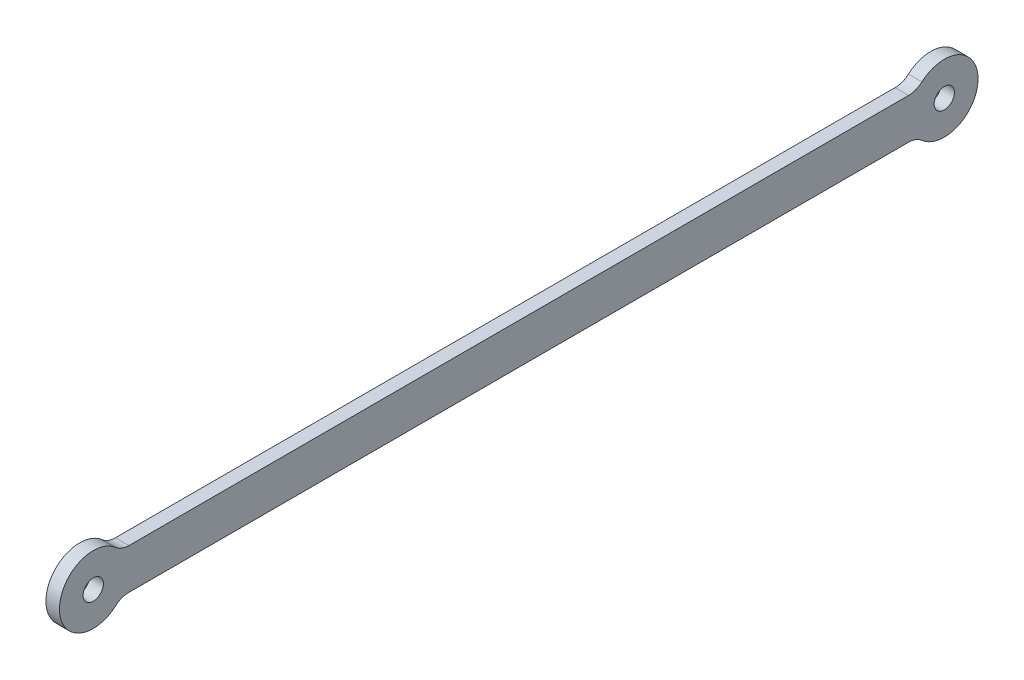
ISO-10303-21;
HEADER;
FILE_DESCRIPTION(('STEP AP214'),'2;1');
FILE_NAME('part.step','',(''),(''),'','','');
FILE_SCHEMA(('AUTOMOTIVE_DESIGN { 1 0 10303 214 1 1 1 1 }'));
ENDSEC;
DATA;
#1=APPLICATION_CONTEXT('core data for automotive mechanical design processes');
#2=APPLICATION_PROTOCOL_DEFINITION('international standard','automotive_design',2000,#1);
#3=PRODUCT_CONTEXT('',#1,'mechanical');
#4=PRODUCT('Part','Part','',(#3));
#5=PRODUCT_RELATED_PRODUCT_CATEGORY('part','',(#4));
#6=PRODUCT_DEFINITION_FORMATION('','',#4);
#7=PRODUCT_DEFINITION_CONTEXT('part definition',#1,'design');
#8=PRODUCT_DEFINITION('design','',#6,#7);
#9=PRODUCT_DEFINITION_SHAPE('','',#8);
#10=(LENGTH_UNIT() NAMED_UNIT(*) SI_UNIT(.MILLI.,.METRE.));
#11=(NAMED_UNIT(*) PLANE_ANGLE_UNIT() SI_UNIT($,.RADIAN.));
#12=(NAMED_UNIT(*) SI_UNIT($,.STERADIAN.) SOLID_ANGLE_UNIT());
#13=UNCERTAINTY_MEASURE_WITH_UNIT(LENGTH_MEASURE(1.E-05),#10,'distance_accuracy_value','');
#14=(GEOMETRIC_REPRESENTATION_CONTEXT(3) GLOBAL_UNCERTAINTY_ASSIGNED_CONTEXT((#13)) GLOBAL_UNIT_ASSIGNED_CONTEXT((#10,
#11,#12)) REPRESENTATION_CONTEXT('',''));
#15=CARTESIAN_POINT('',(0.,0.,0.));
#16=DIRECTION('',(0.,0.,1.));
#17=DIRECTION('',(1.,0.,0.));
#18=AXIS2_PLACEMENT_3D('',#15,#16,#17);
#19=CARTESIAN_POINT('',(2.,0.,0.));
#20=DIRECTION('',(1.,0.,0.));
#21=DIRECTION('',(0.,0.,-1.));
#22=AXIS2_PLACEMENT_3D('',#19,#20,#21);
#23=PLANE('',#22);
#24=CARTESIAN_POINT('',(2.,0.,126.));
#25=DIRECTION('',(1.,0.,0.));
#26=DIRECTION('',(0.,0.,-1.));
#27=AXIS2_PLACEMENT_3D('',#24,#25,#26);
#28=CIRCLE('',#27,5.);
#29=CARTESIAN_POINT('',(2.,3.74999999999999,122.692810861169));
#30=VERTEX_POINT('',#29);
#31=CARTESIAN_POINT('',(2.,-3.75000000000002,122.692810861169));
#32=VERTEX_POINT('',#31);
#33=EDGE_CURVE('E192',#30,#32,#28,.T.);
#34=ORIENTED_EDGE('',*,*,#33,.T.);
#35=CARTESIAN_POINT('',(2.,-6.00000000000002,120.708497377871));
#36=DIRECTION('',(1.,0.,0.));
#37=DIRECTION('',(0.,0.,-1.));
#38=AXIS2_PLACEMENT_3D('',#35,#36,#37);
#39=CIRCLE('',#38,3.);
#40=CARTESIAN_POINT('',(2.,-3.00000000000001,120.708497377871));
#41=VERTEX_POINT('',#40);
#42=EDGE_CURVE('E166',#32,#41,#39,.F.);
#43=ORIENTED_EDGE('',*,*,#42,.T.);
#44=DIRECTION('',(0.,0.,-1.));
#45=VECTOR('',#44,1.);
#46=CARTESIAN_POINT('',(2.,-3.,0.));
#47=LINE('',#46,#45);
#48=CARTESIAN_POINT('',(2.,-3.,5.29150262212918));
#49=VERTEX_POINT('',#48);
#50=EDGE_CURVE('E125',#41,#49,#47,.T.);
#51=ORIENTED_EDGE('',*,*,#50,.T.);
#52=CARTESIAN_POINT('',(2.,-6.,5.29150262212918));
#53=DIRECTION('',(1.,0.,0.));
#54=DIRECTION('',(0.,0.,-1.));
#55=AXIS2_PLACEMENT_3D('',#52,#53,#54);
#56=CIRCLE('',#55,3.);
#57=CARTESIAN_POINT('',(2.,-3.75,3.30718913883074));
#58=VERTEX_POINT('',#57);
#59=EDGE_CURVE('E169',#49,#58,#56,.F.);
#60=ORIENTED_EDGE('',*,*,#59,.T.);
#61=CARTESIAN_POINT('',(2.,0.,0.));
#62=DIRECTION('',(1.,0.,0.));
#63=DIRECTION('',(0.,0.,-1.));
#64=AXIS2_PLACEMENT_3D('',#61,#62,#63);
#65=CIRCLE('',#64,5.);
#66=CARTESIAN_POINT('',(2.,3.75,3.30718913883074));
#67=VERTEX_POINT('',#66);
#68=EDGE_CURVE('E112',#58,#67,#65,.T.);
#69=ORIENTED_EDGE('',*,*,#68,.T.);
#70=CARTESIAN_POINT('',(2.,6.,5.29150262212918));
#71=DIRECTION('',(1.,0.,0.));
#72=DIRECTION('',(0.,0.,-1.));
#73=AXIS2_PLACEMENT_3D('',#70,#71,#72);
#74=CIRCLE('',#73,3.);
#75=CARTESIAN_POINT('',(2.,3.,5.29150262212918));
#76=VERTEX_POINT('',#75);
#77=EDGE_CURVE('E11',#67,#76,#74,.F.);
#78=ORIENTED_EDGE('',*,*,#77,.T.);
#79=DIRECTION('',(0.,0.,1.));
#80=VECTOR('',#79,1.);
#81=CARTESIAN_POINT('',(2.,3.,0.));
#82=LINE('',#81,#80);
#83=CARTESIAN_POINT('',(2.,2.99999999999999,120.708497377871));
#84=VERTEX_POINT('',#83);
#85=EDGE_CURVE('E111',#76,#84,#82,.T.);
#86=ORIENTED_EDGE('',*,*,#85,.T.);
#87=CARTESIAN_POINT('',(2.,5.99999999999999,120.708497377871));
#88=DIRECTION('',(1.,0.,0.));
#89=DIRECTION('',(0.,0.,-1.));
#90=AXIS2_PLACEMENT_3D('',#87,#88,#89);
#91=CIRCLE('',#90,3.);
#92=EDGE_CURVE('E157',#84,#30,#91,.F.);
#93=ORIENTED_EDGE('',*,*,#92,.T.);
#94=EDGE_LOOP('',(#34,#43,#51,#60,#69,#78,#86,#93));
#95=FACE_BOUND('',#94,.T.);
#96=CARTESIAN_POINT('',(2.,0.,126.));
#97=DIRECTION('',(1.,0.,0.));
#98=DIRECTION('',(0.,0.,-1.));
#99=AXIS2_PLACEMENT_3D('',#96,#97,#98);
#100=CIRCLE('',#99,1.5);
#101=CARTESIAN_POINT('',(2.,0.,124.5));
#102=VERTEX_POINT('',#101);
#103=EDGE_CURVE('E212',#102,#102,#100,.T.);
#104=ORIENTED_EDGE('',*,*,#103,.F.);
#105=EDGE_LOOP('',(#104));
#106=FACE_BOUND('',#105,.T.);
#107=CARTESIAN_POINT('',(2.,0.,0.));
#108=DIRECTION('',(1.,0.,0.));
#109=DIRECTION('',(0.,0.,-1.));
#110=AXIS2_PLACEMENT_3D('',#107,#108,#109);
#111=CIRCLE('',#110,1.5);
#112=CARTESIAN_POINT('',(2.,0.,-1.5));
#113=VERTEX_POINT('',#112);
#114=EDGE_CURVE('E204',#113,#113,#111,.T.);
#115=ORIENTED_EDGE('',*,*,#114,.F.);
#116=EDGE_LOOP('',(#115));
#117=FACE_BOUND('',#116,.T.);
#118=ADVANCED_FACE('F42',(#95,#106,#117),#23,.T.);
#119=CARTESIAN_POINT('',(0.,0.,0.));
#120=DIRECTION('',(1.,0.,0.));
#121=DIRECTION('',(0.,0.,-1.));
#122=AXIS2_PLACEMENT_3D('',#119,#120,#121);
#123=PLANE('',#122);
#124=DIRECTION('',(0.,0.,1.));
#125=VECTOR('',#124,1.);
#126=CARTESIAN_POINT('',(0.,3.,0.));
#127=LINE('',#126,#125);
#128=CARTESIAN_POINT('',(0.,3.,5.29150262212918));
#129=VERTEX_POINT('',#128);
#130=CARTESIAN_POINT('',(0.,2.99999999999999,120.708497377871));
#131=VERTEX_POINT('',#130);
#132=EDGE_CURVE('E188',#129,#131,#127,.T.);
#133=ORIENTED_EDGE('',*,*,#132,.F.);
#134=CARTESIAN_POINT('',(0.,6.,5.29150262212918));
#135=DIRECTION('',(1.,0.,0.));
#136=DIRECTION('',(0.,0.,-1.));
#137=AXIS2_PLACEMENT_3D('',#134,#135,#136);
#138=CIRCLE('',#137,3.);
#139=CARTESIAN_POINT('',(0.,3.75,3.30718913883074));
#140=VERTEX_POINT('',#139);
#141=EDGE_CURVE('E51',#129,#140,#138,.T.);
#142=ORIENTED_EDGE('',*,*,#141,.T.);
#143=CARTESIAN_POINT('',(0.,0.,0.));
#144=DIRECTION('',(1.,0.,0.));
#145=DIRECTION('',(0.,0.,-1.));
#146=AXIS2_PLACEMENT_3D('',#143,#144,#145);
#147=CIRCLE('',#146,5.);
#148=CARTESIAN_POINT('',(0.,-3.75,3.30718913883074));
#149=VERTEX_POINT('',#148);
#150=EDGE_CURVE('E180',#140,#149,#147,.F.);
#151=ORIENTED_EDGE('',*,*,#150,.T.);
#152=CARTESIAN_POINT('',(0.,-6.,5.29150262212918));
#153=DIRECTION('',(1.,0.,0.));
#154=DIRECTION('',(0.,0.,-1.));
#155=AXIS2_PLACEMENT_3D('',#152,#153,#154);
#156=CIRCLE('',#155,3.);
#157=CARTESIAN_POINT('',(0.,-3.,5.29150262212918));
#158=VERTEX_POINT('',#157);
#159=EDGE_CURVE('E172',#149,#158,#156,.T.);
#160=ORIENTED_EDGE('',*,*,#159,.T.);
#161=DIRECTION('',(0.,0.,-1.));
#162=VECTOR('',#161,1.);
#163=CARTESIAN_POINT('',(0.,-3.,0.));
#164=LINE('',#163,#162);
#165=CARTESIAN_POINT('',(0.,-3.00000000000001,120.708497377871));
#166=VERTEX_POINT('',#165);
#167=EDGE_CURVE('E126',#166,#158,#164,.T.);
#168=ORIENTED_EDGE('',*,*,#167,.F.);
#169=CARTESIAN_POINT('',(0.,-6.00000000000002,120.708497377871));
#170=DIRECTION('',(1.,0.,0.));
#171=DIRECTION('',(0.,0.,-1.));
#172=AXIS2_PLACEMENT_3D('',#169,#170,#171);
#173=CIRCLE('',#172,3.);
#174=CARTESIAN_POINT('',(0.,-3.75000000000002,122.692810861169));
#175=VERTEX_POINT('',#174);
#176=EDGE_CURVE('E163',#166,#175,#173,.T.);
#177=ORIENTED_EDGE('',*,*,#176,.T.);
#178=CARTESIAN_POINT('',(0.,0.,126.));
#179=DIRECTION('',(1.,0.,0.));
#180=DIRECTION('',(0.,0.,-1.));
#181=AXIS2_PLACEMENT_3D('',#178,#179,#180);
#182=CIRCLE('',#181,5.);
#183=CARTESIAN_POINT('',(0.,3.74999999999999,122.692810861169));
#184=VERTEX_POINT('',#183);
#185=EDGE_CURVE('E196',#175,#184,#182,.F.);
#186=ORIENTED_EDGE('',*,*,#185,.T.);
#187=CARTESIAN_POINT('',(0.,5.99999999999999,120.708497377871));
#188=DIRECTION('',(1.,0.,0.));
#189=DIRECTION('',(0.,0.,-1.));
#190=AXIS2_PLACEMENT_3D('',#187,#188,#189);
#191=CIRCLE('',#190,3.);
#192=EDGE_CURVE('E160',#184,#131,#191,.T.);
#193=ORIENTED_EDGE('',*,*,#192,.T.);
#194=EDGE_LOOP('',(#133,#142,#151,#160,#168,#177,#186,#193));
#195=FACE_BOUND('',#194,.T.);
#196=CARTESIAN_POINT('',(0.,0.,126.));
#197=DIRECTION('',(1.,0.,0.));
#198=DIRECTION('',(0.,0.,-1.));
#199=AXIS2_PLACEMENT_3D('',#196,#197,#198);
#200=CIRCLE('',#199,1.5);
#201=CARTESIAN_POINT('',(0.,0.,124.5));
#202=VERTEX_POINT('',#201);
#203=EDGE_CURVE('E208',#202,#202,#200,.T.);
#204=ORIENTED_EDGE('',*,*,#203,.T.);
#205=EDGE_LOOP('',(#204));
#206=FACE_BOUND('',#205,.T.);
#207=CARTESIAN_POINT('',(0.,0.,0.));
#208=DIRECTION('',(1.,0.,0.));
#209=DIRECTION('',(0.,0.,-1.));
#210=AXIS2_PLACEMENT_3D('',#207,#208,#209);
#211=CIRCLE('',#210,1.5);
#212=CARTESIAN_POINT('',(0.,0.,-1.5));
#213=VERTEX_POINT('',#212);
#214=EDGE_CURVE('E202',#213,#213,#211,.T.);
#215=ORIENTED_EDGE('',*,*,#214,.T.);
#216=EDGE_LOOP('',(#215));
#217=FACE_BOUND('',#216,.T.);
#218=ADVANCED_FACE('F178',(#195,#206,#217),#123,.F.);
#219=CARTESIAN_POINT('',(2.,3.,0.));
#220=DIRECTION('',(0.,-1.,0.));
#221=DIRECTION('',(0.,0.,-1.));
#222=AXIS2_PLACEMENT_3D('',#219,#220,#221);
#223=PLANE('',#222);
#224=ORIENTED_EDGE('',*,*,#132,.T.);
#225=DIRECTION('',(1.,0.,0.));
#226=VECTOR('',#225,1.);
#227=CARTESIAN_POINT('',(2.,2.99999999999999,120.708497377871));
#228=LINE('',#227,#226);
#229=EDGE_CURVE('E123',#131,#84,#228,.T.);
#230=ORIENTED_EDGE('',*,*,#229,.T.);
#231=ORIENTED_EDGE('',*,*,#85,.F.);
#232=DIRECTION('',(1.,0.,0.));
#233=VECTOR('',#232,1.);
#234=CARTESIAN_POINT('',(2.,3.,5.29150262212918));
#235=LINE('',#234,#233);
#236=EDGE_CURVE('E121',#76,#129,#235,.F.);
#237=ORIENTED_EDGE('',*,*,#236,.T.);
#238=EDGE_LOOP('',(#224,#230,#231,#237));
#239=FACE_BOUND('',#238,.T.);
#240=ADVANCED_FACE('F120',(#239),#223,.F.);
#241=CARTESIAN_POINT('',(2.,-3.,0.));
#242=DIRECTION('',(0.,1.,0.));
#243=DIRECTION('',(0.,0.,1.));
#244=AXIS2_PLACEMENT_3D('',#241,#242,#243);
#245=PLANE('',#244);
#246=ORIENTED_EDGE('',*,*,#50,.F.);
#247=DIRECTION('',(1.,0.,0.));
#248=VECTOR('',#247,1.);
#249=CARTESIAN_POINT('',(2.,-3.00000000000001,120.708497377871));
#250=LINE('',#249,#248);
#251=EDGE_CURVE('E148',#41,#166,#250,.F.);
#252=ORIENTED_EDGE('',*,*,#251,.T.);
#253=ORIENTED_EDGE('',*,*,#167,.T.);
#254=DIRECTION('',(1.,0.,0.));
#255=VECTOR('',#254,1.);
#256=CARTESIAN_POINT('',(2.,-3.,5.29150262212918));
#257=LINE('',#256,#255);
#258=EDGE_CURVE('E144',#158,#49,#257,.T.);
#259=ORIENTED_EDGE('',*,*,#258,.T.);
#260=EDGE_LOOP('',(#246,#252,#253,#259));
#261=FACE_BOUND('',#260,.T.);
#262=ADVANCED_FACE('F185',(#261),#245,.F.);
#263=CARTESIAN_POINT('',(2.,0.,126.));
#264=DIRECTION('',(-1.,0.,0.));
#265=DIRECTION('',(0.,0.,1.));
#266=AXIS2_PLACEMENT_3D('',#263,#264,#265);
#267=CYLINDRICAL_SURFACE('',#266,1.5);
#268=ORIENTED_EDGE('',*,*,#103,.T.);
#269=EDGE_LOOP('',(#268));
#270=FACE_BOUND('',#269,.T.);
#271=ORIENTED_EDGE('',*,*,#203,.F.);
#272=EDGE_LOOP('',(#271));
#273=FACE_BOUND('',#272,.T.);
#274=ADVANCED_FACE('F245',(#270,#273),#267,.F.);
#275=CARTESIAN_POINT('',(2.,0.,0.));
#276=DIRECTION('',(-1.,0.,0.));
#277=DIRECTION('',(0.,0.,1.));
#278=AXIS2_PLACEMENT_3D('',#275,#276,#277);
#279=CYLINDRICAL_SURFACE('',#278,1.5);
#280=ORIENTED_EDGE('',*,*,#114,.T.);
#281=EDGE_LOOP('',(#280));
#282=FACE_BOUND('',#281,.T.);
#283=ORIENTED_EDGE('',*,*,#214,.F.);
#284=EDGE_LOOP('',(#283));
#285=FACE_BOUND('',#284,.T.);
#286=ADVANCED_FACE('F266',(#282,#285),#279,.F.);
#287=CARTESIAN_POINT('',(-14.142135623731,0.,126.));
#288=DIRECTION('',(1.,0.,0.));
#289=DIRECTION('',(0.,0.,-1.));
#290=AXIS2_PLACEMENT_3D('',#287,#288,#289);
#291=CYLINDRICAL_SURFACE('',#290,5.);
#292=ORIENTED_EDGE('',*,*,#33,.F.);
#293=DIRECTION('',(1.,0.,0.));
#294=VECTOR('',#293,1.);
#295=CARTESIAN_POINT('',(-14.142135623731,3.74999999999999,122.692810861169));
#296=LINE('',#295,#294);
#297=EDGE_CURVE('E141',#30,#184,#296,.F.);
#298=ORIENTED_EDGE('',*,*,#297,.T.);
#299=ORIENTED_EDGE('',*,*,#185,.F.);
#300=DIRECTION('',(1.,0.,0.));
#301=VECTOR('',#300,1.);
#302=CARTESIAN_POINT('',(-14.142135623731,-3.75000000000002,122.692810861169));
#303=LINE('',#302,#301);
#304=EDGE_CURVE('E132',#175,#32,#303,.T.);
#305=ORIENTED_EDGE('',*,*,#304,.T.);
#306=EDGE_LOOP('',(#292,#298,#299,#305));
#307=FACE_BOUND('',#306,.T.);
#308=ADVANCED_FACE('F226',(#307),#291,.T.);
#309=CARTESIAN_POINT('',(-14.142135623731,0.,0.));
#310=DIRECTION('',(1.,0.,0.));
#311=DIRECTION('',(0.,0.,-1.));
#312=AXIS2_PLACEMENT_3D('',#309,#310,#311);
#313=CYLINDRICAL_SURFACE('',#312,5.);
#314=ORIENTED_EDGE('',*,*,#68,.F.);
#315=DIRECTION('',(1.,0.,0.));
#316=VECTOR('',#315,1.);
#317=CARTESIAN_POINT('',(-14.142135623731,-3.75,3.30718913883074));
#318=LINE('',#317,#316);
#319=EDGE_CURVE('E58',#58,#149,#318,.F.);
#320=ORIENTED_EDGE('',*,*,#319,.T.);
#321=ORIENTED_EDGE('',*,*,#150,.F.);
#322=DIRECTION('',(1.,0.,0.));
#323=VECTOR('',#322,1.);
#324=CARTESIAN_POINT('',(-14.142135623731,3.75,3.30718913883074));
#325=LINE('',#324,#323);
#326=EDGE_CURVE('E152',#140,#67,#325,.T.);
#327=ORIENTED_EDGE('',*,*,#326,.T.);
#328=EDGE_LOOP('',(#314,#320,#321,#327));
#329=FACE_BOUND('',#328,.T.);
#330=ADVANCED_FACE('F190',(#329),#313,.T.);
#331=CARTESIAN_POINT('',(-14.142135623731,5.99999999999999,120.708497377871));
#332=DIRECTION('',(1.,0.,0.));
#333=DIRECTION('',(0.,0.,-1.));
#334=AXIS2_PLACEMENT_3D('',#331,#332,#333);
#335=CYLINDRICAL_SURFACE('',#334,3.);
#336=ORIENTED_EDGE('',*,*,#192,.F.);
#337=ORIENTED_EDGE('',*,*,#297,.F.);
#338=ORIENTED_EDGE('',*,*,#92,.F.);
#339=ORIENTED_EDGE('',*,*,#229,.F.);
#340=EDGE_LOOP('',(#336,#337,#338,#339));
#341=FACE_BOUND('',#340,.T.);
#342=ADVANCED_FACE('F221',(#341),#335,.F.);
#343=CARTESIAN_POINT('',(-14.142135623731,-6.00000000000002,120.708497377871));
#344=DIRECTION('',(1.,0.,0.));
#345=DIRECTION('',(0.,0.,-1.));
#346=AXIS2_PLACEMENT_3D('',#343,#344,#345);
#347=CYLINDRICAL_SURFACE('',#346,3.);
#348=ORIENTED_EDGE('',*,*,#42,.F.);
#349=ORIENTED_EDGE('',*,*,#304,.F.);
#350=ORIENTED_EDGE('',*,*,#176,.F.);
#351=ORIENTED_EDGE('',*,*,#251,.F.);
#352=EDGE_LOOP('',(#348,#349,#350,#351));
#353=FACE_BOUND('',#352,.T.);
#354=ADVANCED_FACE('F230',(#353),#347,.F.);
#355=CARTESIAN_POINT('',(-14.142135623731,-6.,5.29150262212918));
#356=DIRECTION('',(1.,0.,0.));
#357=DIRECTION('',(0.,0.,-1.));
#358=AXIS2_PLACEMENT_3D('',#355,#356,#357);
#359=CYLINDRICAL_SURFACE('',#358,3.);
#360=ORIENTED_EDGE('',*,*,#159,.F.);
#361=ORIENTED_EDGE('',*,*,#319,.F.);
#362=ORIENTED_EDGE('',*,*,#59,.F.);
#363=ORIENTED_EDGE('',*,*,#258,.F.);
#364=EDGE_LOOP('',(#360,#361,#362,#363));
#365=FACE_BOUND('',#364,.T.);
#366=ADVANCED_FACE('F189',(#365),#359,.F.);
#367=CARTESIAN_POINT('',(-14.142135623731,6.,5.29150262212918));
#368=DIRECTION('',(1.,0.,0.));
#369=DIRECTION('',(0.,0.,-1.));
#370=AXIS2_PLACEMENT_3D('',#367,#368,#369);
#371=CYLINDRICAL_SURFACE('',#370,3.);
#372=ORIENTED_EDGE('',*,*,#77,.F.);
#373=ORIENTED_EDGE('',*,*,#326,.F.);
#374=ORIENTED_EDGE('',*,*,#141,.F.);
#375=ORIENTED_EDGE('',*,*,#236,.F.);
#376=EDGE_LOOP('',(#372,#373,#374,#375));
#377=FACE_BOUND('',#376,.T.);
#378=ADVANCED_FACE('F44',(#377),#371,.F.);
#379=CLOSED_SHELL('',(#118,#218,#240,#262,#274,#286,#308,#330,#342,#354,#366,#378));
#380=MANIFOLD_SOLID_BREP('B2',#379);
#381=ADVANCED_BREP_SHAPE_REPRESENTATION('',(#18,#380),#14);
#382=SHAPE_DEFINITION_REPRESENTATION(#9,#381);
ENDSEC;
END-ISO-10303-21;
